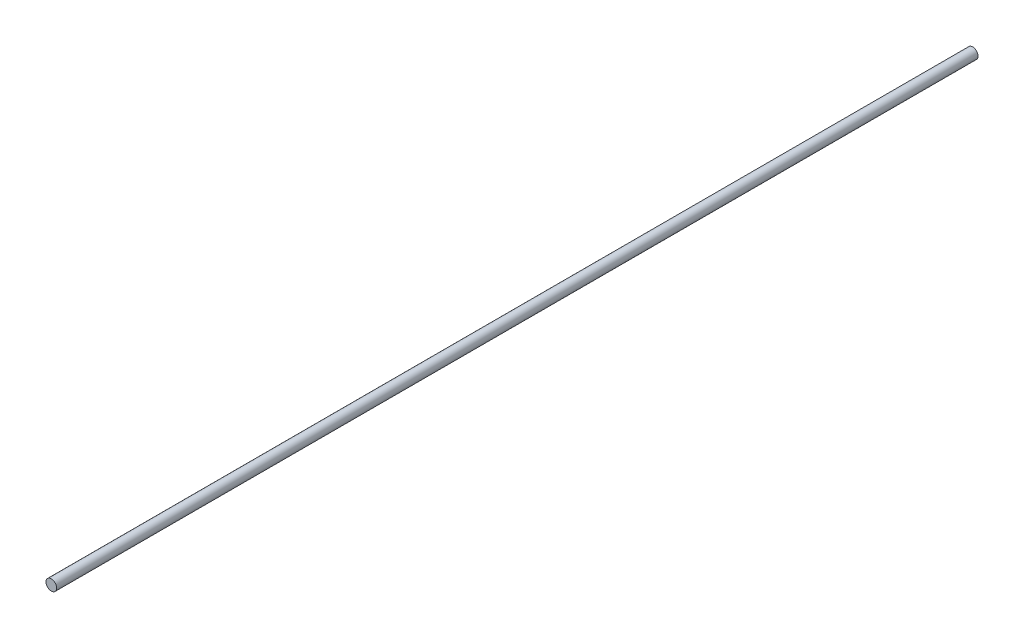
ISO-10303-21;
HEADER;
FILE_DESCRIPTION(('STEP AP214'),'2;1');
FILE_NAME('part.step','',(''),(''),'','','');
FILE_SCHEMA(('AUTOMOTIVE_DESIGN { 1 0 10303 214 1 1 1 1 }'));
ENDSEC;
DATA;
#1=APPLICATION_CONTEXT('core data for automotive mechanical design processes');
#2=APPLICATION_PROTOCOL_DEFINITION('international standard','automotive_design',2000,#1);
#3=PRODUCT_CONTEXT('',#1,'mechanical');
#4=PRODUCT('Part','Part','',(#3));
#5=PRODUCT_RELATED_PRODUCT_CATEGORY('part','',(#4));
#6=PRODUCT_DEFINITION_FORMATION('','',#4);
#7=PRODUCT_DEFINITION_CONTEXT('part definition',#1,'design');
#8=PRODUCT_DEFINITION('design','',#6,#7);
#9=PRODUCT_DEFINITION_SHAPE('','',#8);
#10=(LENGTH_UNIT() NAMED_UNIT(*) SI_UNIT(.MILLI.,.METRE.));
#11=(NAMED_UNIT(*) PLANE_ANGLE_UNIT() SI_UNIT($,.RADIAN.));
#12=(NAMED_UNIT(*) SI_UNIT($,.STERADIAN.) SOLID_ANGLE_UNIT());
#13=UNCERTAINTY_MEASURE_WITH_UNIT(LENGTH_MEASURE(1.E-05),#10,'distance_accuracy_value','');
#14=(GEOMETRIC_REPRESENTATION_CONTEXT(3) GLOBAL_UNCERTAINTY_ASSIGNED_CONTEXT((#13)) GLOBAL_UNIT_ASSIGNED_CONTEXT((#10,
#11,#12)) REPRESENTATION_CONTEXT('',''));
#15=CARTESIAN_POINT('',(0.,0.,0.));
#16=DIRECTION('',(0.,0.,1.));
#17=DIRECTION('',(1.,0.,0.));
#18=AXIS2_PLACEMENT_3D('',#15,#16,#17);
#19=CARTESIAN_POINT('',(0.,0.,-5200.));
#20=DIRECTION('',(0.,0.,1.));
#21=DIRECTION('',(1.,0.,0.));
#22=AXIS2_PLACEMENT_3D('',#19,#20,#21);
#23=CYLINDRICAL_SURFACE('',#22,30.);
#24=CARTESIAN_POINT('',(0.,0.,-5200.));
#25=DIRECTION('',(0.,0.,1.));
#26=DIRECTION('',(1.,0.,0.));
#27=AXIS2_PLACEMENT_3D('',#24,#25,#26);
#28=CIRCLE('',#27,30.);
#29=CARTESIAN_POINT('',(30.,0.,-5200.));
#30=VERTEX_POINT('',#29);
#31=EDGE_CURVE('E10',#30,#30,#28,.T.);
#32=ORIENTED_EDGE('',*,*,#31,.T.);
#33=EDGE_LOOP('',(#32));
#34=FACE_BOUND('',#33,.T.);
#35=CARTESIAN_POINT('',(0.,0.,0.));
#36=DIRECTION('',(0.,0.,1.));
#37=DIRECTION('',(1.,0.,0.));
#38=AXIS2_PLACEMENT_3D('',#35,#36,#37);
#39=CIRCLE('',#38,30.);
#40=CARTESIAN_POINT('',(30.,0.,0.));
#41=VERTEX_POINT('',#40);
#42=EDGE_CURVE('E40',#41,#41,#39,.T.);
#43=ORIENTED_EDGE('',*,*,#42,.F.);
#44=EDGE_LOOP('',(#43));
#45=FACE_BOUND('',#44,.T.);
#46=ADVANCED_FACE('F37',(#34,#45),#23,.T.);
#47=CARTESIAN_POINT('',(0.,0.,-5200.));
#48=DIRECTION('',(0.,0.,1.));
#49=DIRECTION('',(1.,0.,0.));
#50=AXIS2_PLACEMENT_3D('',#47,#48,#49);
#51=PLANE('',#50);
#52=ORIENTED_EDGE('',*,*,#31,.F.);
#53=EDGE_LOOP('',(#52));
#54=FACE_BOUND('',#53,.T.);
#55=ADVANCED_FACE('F54',(#54),#51,.F.);
#56=CARTESIAN_POINT('',(0.,0.,0.));
#57=DIRECTION('',(0.,0.,1.));
#58=DIRECTION('',(1.,0.,0.));
#59=AXIS2_PLACEMENT_3D('',#56,#57,#58);
#60=PLANE('',#59);
#61=ORIENTED_EDGE('',*,*,#42,.T.);
#62=EDGE_LOOP('',(#61));
#63=FACE_BOUND('',#62,.T.);
#64=ADVANCED_FACE('F51',(#63),#60,.T.);
#65=CLOSED_SHELL('',(#46,#55,#64));
#66=MANIFOLD_SOLID_BREP('B2',#65);
#67=ADVANCED_BREP_SHAPE_REPRESENTATION('',(#18,#66),#14);
#68=SHAPE_DEFINITION_REPRESENTATION(#9,#67);
ENDSEC;
END-ISO-10303-21;
